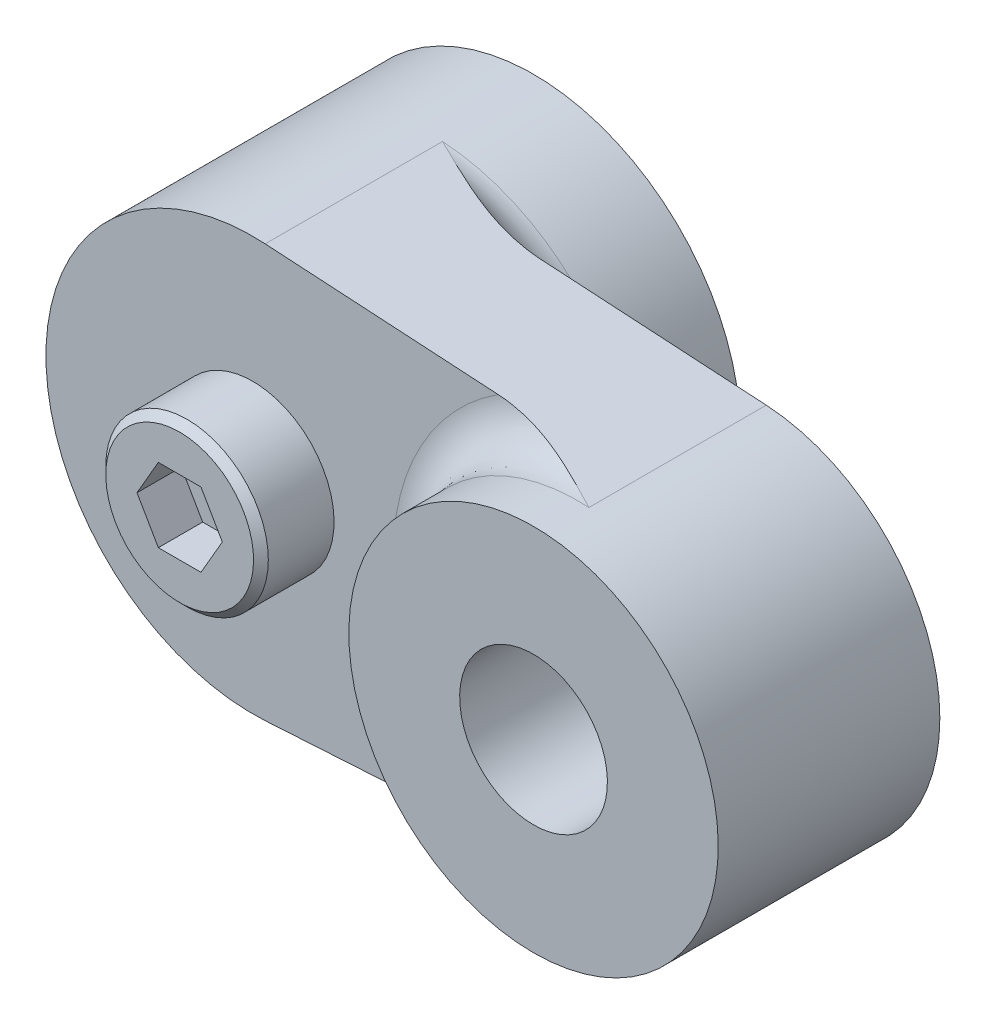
ISO-10303-21;
HEADER;
FILE_DESCRIPTION(('STEP AP214'),'2;1');
FILE_NAME('part.step','',(''),(''),'','','');
FILE_SCHEMA(('AUTOMOTIVE_DESIGN { 1 0 10303 214 1 1 1 1 }'));
ENDSEC;
DATA;
#1=APPLICATION_CONTEXT('core data for automotive mechanical design processes');
#2=APPLICATION_PROTOCOL_DEFINITION('international standard','automotive_design',2000,#1);
#3=PRODUCT_CONTEXT('',#1,'mechanical');
#4=PRODUCT('Part','Part','',(#3));
#5=PRODUCT_RELATED_PRODUCT_CATEGORY('part','',(#4));
#6=PRODUCT_DEFINITION_FORMATION('','',#4);
#7=PRODUCT_DEFINITION_CONTEXT('part definition',#1,'design');
#8=PRODUCT_DEFINITION('design','',#6,#7);
#9=PRODUCT_DEFINITION_SHAPE('','',#8);
#10=(LENGTH_UNIT() NAMED_UNIT(*) SI_UNIT(.MILLI.,.METRE.));
#11=(NAMED_UNIT(*) PLANE_ANGLE_UNIT() SI_UNIT($,.RADIAN.));
#12=(NAMED_UNIT(*) SI_UNIT($,.STERADIAN.) SOLID_ANGLE_UNIT());
#13=UNCERTAINTY_MEASURE_WITH_UNIT(LENGTH_MEASURE(1.E-05),#10,'distance_accuracy_value','');
#14=(GEOMETRIC_REPRESENTATION_CONTEXT(3) GLOBAL_UNCERTAINTY_ASSIGNED_CONTEXT((#13)) GLOBAL_UNIT_ASSIGNED_CONTEXT((#10,
#11,#12)) REPRESENTATION_CONTEXT('',''));
#15=CARTESIAN_POINT('',(0.,0.,0.));
#16=DIRECTION('',(0.,0.,1.));
#17=DIRECTION('',(1.,0.,0.));
#18=AXIS2_PLACEMENT_3D('',#15,#16,#17);
#19=CARTESIAN_POINT('',(25.75,-12.4774797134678,25.));
#20=DIRECTION('',(0.06,-0.998198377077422,0.));
#21=DIRECTION('',(0.998198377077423,0.06,0.));
#22=AXIS2_PLACEMENT_3D('',#19,#20,#21);
#23=PLANE('',#22);
#24=DIRECTION('',(0.,0.,-1.));
#25=VECTOR('',#24,1.);
#26=CARTESIAN_POINT('',(0.84,-13.9747772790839,25.));
#27=LINE('',#26,#25);
#28=CARTESIAN_POINT('',(0.84,-13.9747772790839,19.));
#29=VERTEX_POINT('',#28);
#30=CARTESIAN_POINT('',(0.84,-13.9747772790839,7.));
#31=VERTEX_POINT('',#30);
#32=EDGE_CURVE('E191',#29,#31,#27,.T.);
#33=ORIENTED_EDGE('',*,*,#32,.T.);
#34=CARTESIAN_POINT('',(10.4662765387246,-13.3961582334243,10.));
#35=CARTESIAN_POINT('',(10.2901574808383,-13.4067444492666,9.99997897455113));
#36=CARTESIAN_POINT('',(10.1140935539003,-13.4173273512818,9.99499251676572));
#37=CARTESIAN_POINT('',(9.76254126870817,-13.4384585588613,9.97605534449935));
#38=CARTESIAN_POINT('',(9.58705263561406,-13.4490068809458,9.96210983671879));
#39=CARTESIAN_POINT('',(9.23741470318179,-13.4700230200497,9.92627055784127));
#40=CARTESIAN_POINT('',(9.06326300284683,-13.4804909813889,9.90439977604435));
#41=CARTESIAN_POINT('',(8.71598721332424,-13.5013651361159,9.85351916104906));
#42=CARTESIAN_POINT('',(8.5428632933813,-13.5117713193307,9.82450818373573));
#43=CARTESIAN_POINT('',(8.02934239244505,-13.5426381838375,9.7286557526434));
#44=CARTESIAN_POINT('',(7.69065497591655,-13.5629961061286,9.65253290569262));
#45=CARTESIAN_POINT('',(7.01823457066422,-13.6034141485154,9.48023699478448));
#46=CARTESIAN_POINT('',(6.68450601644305,-13.6234740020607,9.38404702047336));
#47=CARTESIAN_POINT('',(5.8813279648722,-13.671751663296,9.13151508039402));
#48=CARTESIAN_POINT('',(5.4144622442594,-13.6998141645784,8.96698070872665));
#49=CARTESIAN_POINT('',(4.48940947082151,-13.7554175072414,8.61551577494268));
#50=CARTESIAN_POINT('',(4.03122240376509,-13.7829583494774,8.4285852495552));
#51=CARTESIAN_POINT('',(2.66290255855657,-13.8652057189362,7.84532166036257));
#52=CARTESIAN_POINT('',(1.76202665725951,-13.9193558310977,7.42758543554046));
#53=CARTESIAN_POINT('',(0.85429087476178,-13.973918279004,7.00662731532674));
#54=CARTESIAN_POINT('',(0.847145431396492,-13.9743477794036,7.00331364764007));
#55=CARTESIAN_POINT('',(0.84,-13.9747772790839,7.));
#56=B_SPLINE_CURVE_WITH_KNOTS('',3,(#34,#35,#36,#37,#38,#39,#40,#41,#42,#43,#44,#45,#46,#47,#48,
#49,#50,#51,#52,#53,#54,#55),.UNSPECIFIED.,.F.,.F.,(4,2,2,2,2,2,2,2,2,2,4),(0.,
0.529161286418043,1.05801531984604,1.58534739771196,2.1127640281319,3.15510729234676,
4.19833250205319,5.68482585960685,7.17131677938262,10.1538893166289,10.1775536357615),.UNSPECIFIED.);
#57=CARTESIAN_POINT('',(10.4662765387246,-13.3961582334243,10.));
#58=VERTEX_POINT('',#57);
#59=EDGE_CURVE('E37',#31,#58,#56,.F.);
#60=ORIENTED_EDGE('',*,*,#59,.T.);
#61=DIRECTION('',(-0.998198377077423,-0.06,0.));
#62=VECTOR('',#61,1.);
#63=CARTESIAN_POINT('',(25.75,-12.4774797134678,10.));
#64=LINE('',#63,#62);
#65=CARTESIAN_POINT('',(25.75,-12.4774797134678,10.));
#66=VERTEX_POINT('',#65);
#67=EDGE_CURVE('E163',#66,#58,#64,.T.);
#68=ORIENTED_EDGE('',*,*,#67,.F.);
#69=DIRECTION('',(0.,0.,-1.));
#70=VECTOR('',#69,1.);
#71=CARTESIAN_POINT('',(25.75,-12.4774797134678,25.));
#72=LINE('',#71,#70);
#73=CARTESIAN_POINT('',(25.75,-12.4774797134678,22.));
#74=VERTEX_POINT('',#73);
#75=EDGE_CURVE('E188',#74,#66,#72,.T.);
#76=ORIENTED_EDGE('',*,*,#75,.F.);
#77=CARTESIAN_POINT('',(16.6013607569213,-13.0273887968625,19.));
#78=CARTESIAN_POINT('',(16.7645065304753,-13.0175823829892,19.0000163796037));
#79=CARTESIAN_POINT('',(16.9276028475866,-13.0077789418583,19.0046687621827));
#80=CARTESIAN_POINT('',(17.2532529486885,-12.9882046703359,19.0223867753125));
#81=CARTESIAN_POINT('',(17.4158069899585,-12.9784338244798,19.0354475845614));
#82=CARTESIAN_POINT('',(17.739642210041,-12.9589686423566,19.0690764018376));
#83=CARTESIAN_POINT('',(17.900925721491,-12.9492741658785,19.0896223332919));
#84=CARTESIAN_POINT('',(18.2225001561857,-12.9299448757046,19.1374908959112));
#85=CARTESIAN_POINT('',(18.3827909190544,-12.9203100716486,19.164814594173));
#86=CARTESIAN_POINT('',(18.8578431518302,-12.8917554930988,19.2551475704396));
#87=CARTESIAN_POINT('',(19.1709492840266,-12.8729352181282,19.326988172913));
#88=CARTESIAN_POINT('',(19.7922779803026,-12.8355882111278,19.4899355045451));
#89=CARTESIAN_POINT('',(20.1004961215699,-12.8170617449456,19.5810587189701));
#90=CARTESIAN_POINT('',(20.8658664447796,-12.7710566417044,19.8284891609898));
#91=CARTESIAN_POINT('',(21.3198697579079,-12.7437672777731,19.9945156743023));
#92=CARTESIAN_POINT('',(22.2181612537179,-12.6897725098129,20.3506648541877));
#93=CARTESIAN_POINT('',(22.6624485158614,-12.6630671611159,20.5407897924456));
#94=CARTESIAN_POINT('',(23.9882324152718,-12.5833765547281,21.1353894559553));
#95=CARTESIAN_POINT('',(24.8592612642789,-12.5310204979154,21.5628415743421));
#96=CARTESIAN_POINT('',(25.7366371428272,-12.4782829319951,21.9934417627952));
#97=CARTESIAN_POINT('',(25.74331857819,-12.4778813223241,21.996720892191));
#98=CARTESIAN_POINT('',(25.75,-12.4774797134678,22.));
#99=B_SPLINE_CURVE_WITH_KNOTS('',3,(#77,#78,#79,#80,#81,#82,#83,#84,#85,#86,#87,#88,#89,#90,#91,
#92,#93,#94,#95,#96,#97,#98),.UNSPECIFIED.,.F.,.F.,(4,2,2,2,2,2,2,2,2,2,4),(0.,
0.490183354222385,0.980085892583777,1.46855506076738,1.95710118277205,2.92163302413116,
3.88699282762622,5.33841179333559,6.78996768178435,9.70390170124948,9.72626238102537),.UNSPECIFIED.);
#100=CARTESIAN_POINT('',(16.6013607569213,-13.0273887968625,19.));
#101=VERTEX_POINT('',#100);
#102=EDGE_CURVE('E203',#74,#101,#99,.F.);
#103=ORIENTED_EDGE('',*,*,#102,.T.);
#104=DIRECTION('',(0.998198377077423,0.06,0.));
#105=VECTOR('',#104,1.);
#106=CARTESIAN_POINT('',(0.84,-13.9747772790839,19.));
#107=LINE('',#106,#105);
#108=EDGE_CURVE('E171',#29,#101,#107,.T.);
#109=ORIENTED_EDGE('',*,*,#108,.F.);
#110=EDGE_LOOP('',(#33,#60,#68,#76,#103,#109));
#111=FACE_BOUND('',#110,.T.);
#112=ADVANCED_FACE('F14',(#111),#23,.T.);
#113=CARTESIAN_POINT('',(25.75,12.4774797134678,25.));
#114=DIRECTION('',(-0.06,-0.998198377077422,0.));
#115=DIRECTION('',(0.998198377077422,-0.06,0.));
#116=AXIS2_PLACEMENT_3D('',#113,#114,#115);
#117=PLANE('',#116);
#118=DIRECTION('',(0.998198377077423,-0.06,0.));
#119=VECTOR('',#118,1.);
#120=CARTESIAN_POINT('',(0.84,13.9747772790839,10.));
#121=LINE('',#120,#119);
#122=CARTESIAN_POINT('',(10.4662765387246,13.3961582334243,10.));
#123=VERTEX_POINT('',#122);
#124=CARTESIAN_POINT('',(25.75,12.4774797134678,10.));
#125=VERTEX_POINT('',#124);
#126=EDGE_CURVE('E167',#123,#125,#121,.T.);
#127=ORIENTED_EDGE('',*,*,#126,.F.);
#128=CARTESIAN_POINT('',(10.4662765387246,13.3961582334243,10.));
#129=CARTESIAN_POINT('',(10.2901574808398,13.4067444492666,9.99997897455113));
#130=CARTESIAN_POINT('',(10.1140935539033,13.4173273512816,9.99499251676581));
#131=CARTESIAN_POINT('',(9.76254126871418,13.4384585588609,9.97605534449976));
#132=CARTESIAN_POINT('',(9.58705263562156,13.4490068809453,9.96210983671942));
#133=CARTESIAN_POINT('',(9.23741470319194,13.4700230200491,9.92627055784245));
#134=CARTESIAN_POINT('',(9.06326300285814,13.4804909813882,9.90439977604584));
#135=CARTESIAN_POINT('',(8.71598721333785,13.5013651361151,9.85351916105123));
#136=CARTESIAN_POINT('',(8.54286329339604,13.5117713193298,9.82450818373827));
#137=CARTESIAN_POINT('',(8.02934239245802,13.5426381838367,9.72865575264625));
#138=CARTESIAN_POINT('',(7.69065497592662,13.5629961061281,9.65253290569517));
#139=CARTESIAN_POINT('',(7.01823457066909,13.6034141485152,9.48023699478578));
#140=CARTESIAN_POINT('',(6.68450601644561,13.6234740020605,9.38404702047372));
#141=CARTESIAN_POINT('',(5.88132796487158,13.6717516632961,9.13151508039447));
#142=CARTESIAN_POINT('',(5.41446224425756,13.6998141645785,8.96698070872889));
#143=CARTESIAN_POINT('',(4.48940947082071,13.7554175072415,8.61551577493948));
#144=CARTESIAN_POINT('',(4.03122240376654,13.7829583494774,8.42858524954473));
#145=CARTESIAN_POINT('',(2.66290255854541,13.8652057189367,7.84532166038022));
#146=CARTESIAN_POINT('',(1.76202665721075,13.9193558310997,7.42758543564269));
#147=CARTESIAN_POINT('',(0.85429087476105,13.973918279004,7.00662731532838));
#148=CARTESIAN_POINT('',(0.847145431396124,13.9743477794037,7.0033136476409));
#149=CARTESIAN_POINT('',(0.84,13.9747772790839,7.));
#150=B_SPLINE_CURVE_WITH_KNOTS('',3,(#128,#129,#130,#131,#132,#133,#134,#135,#136,#137,#138,
#139,#140,#141,#142,#143,#144,#145,#146,#147,#148,#149),.UNSPECIFIED.,.F.,.F.,(4,2,2,2,2,2,2,2,
2,2,4),(0.,0.529161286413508,1.05801531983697,1.58534739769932,2.11276402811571,
3.15510729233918,4.1983325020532,5.68482585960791,7.17131677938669,10.1538893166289,
10.1775536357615),.UNSPECIFIED.);
#151=CARTESIAN_POINT('',(0.84,13.9747772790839,7.));
#152=VERTEX_POINT('',#151);
#153=EDGE_CURVE('E255',#123,#152,#150,.T.);
#154=ORIENTED_EDGE('',*,*,#153,.T.);
#155=DIRECTION('',(0.,0.,-1.));
#156=VECTOR('',#155,1.);
#157=CARTESIAN_POINT('',(0.84,13.9747772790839,25.));
#158=LINE('',#157,#156);
#159=CARTESIAN_POINT('',(0.84,13.9747772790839,19.));
#160=VERTEX_POINT('',#159);
#161=EDGE_CURVE('E182',#160,#152,#158,.T.);
#162=ORIENTED_EDGE('',*,*,#161,.F.);
#163=DIRECTION('',(-0.998198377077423,0.06,0.));
#164=VECTOR('',#163,1.);
#165=CARTESIAN_POINT('',(25.75,12.4774797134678,19.));
#166=LINE('',#165,#164);
#167=CARTESIAN_POINT('',(16.6013607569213,13.0273887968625,19.));
#168=VERTEX_POINT('',#167);
#169=EDGE_CURVE('E174',#168,#160,#166,.T.);
#170=ORIENTED_EDGE('',*,*,#169,.F.);
#171=CARTESIAN_POINT('',(16.6013607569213,13.0273887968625,19.));
#172=CARTESIAN_POINT('',(16.7645065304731,13.0175823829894,19.0000163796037));
#173=CARTESIAN_POINT('',(16.9276028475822,13.0077789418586,19.0046687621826));
#174=CARTESIAN_POINT('',(17.2532529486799,12.9882046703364,19.0223867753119));
#175=CARTESIAN_POINT('',(17.4158069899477,12.9784338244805,19.0354475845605));
#176=CARTESIAN_POINT('',(17.7396422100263,12.9589686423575,19.0690764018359));
#177=CARTESIAN_POINT('',(17.9009257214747,12.9492741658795,19.0896223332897));
#178=CARTESIAN_POINT('',(18.2225001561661,12.9299448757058,19.137490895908));
#179=CARTESIAN_POINT('',(18.3827909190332,12.9203100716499,19.1648145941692));
#180=CARTESIAN_POINT('',(18.8578431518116,12.8917554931,19.2551475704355));
#181=CARTESIAN_POINT('',(19.1709492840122,12.8729352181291,19.3269881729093));
#182=CARTESIAN_POINT('',(19.7922779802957,12.8355882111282,19.4899355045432));
#183=CARTESIAN_POINT('',(20.1004961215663,12.8170617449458,19.5810587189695));
#184=CARTESIAN_POINT('',(20.8658664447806,12.7710566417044,19.8284891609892));
#185=CARTESIAN_POINT('',(21.3198697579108,12.743767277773,19.9945156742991));
#186=CARTESIAN_POINT('',(22.2181612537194,12.6897725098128,20.3506648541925));
#187=CARTESIAN_POINT('',(22.6624485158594,12.6630671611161,20.5407897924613));
#188=CARTESIAN_POINT('',(23.9882324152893,12.583376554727,21.1353894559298));
#189=CARTESIAN_POINT('',(24.8592612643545,12.5310204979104,21.5628415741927));
#190=CARTESIAN_POINT('',(25.7366371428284,12.478282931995,21.9934417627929));
#191=CARTESIAN_POINT('',(25.7433185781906,12.4778813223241,21.9967208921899));
#192=CARTESIAN_POINT('',(25.75,12.4774797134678,22.));
#193=B_SPLINE_CURVE_WITH_KNOTS('',3,(#171,#172,#173,#174,#175,#176,#177,#178,#179,#180,#181,
#182,#183,#184,#185,#186,#187,#188,#189,#190,#191,#192),.UNSPECIFIED.,.F.,.F.,(4,2,2,2,2,2,2,2,
2,2,4),(0.,0.490183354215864,0.98008589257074,1.46855506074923,1.9571011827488,2.92163302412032,
3.88699282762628,5.33841179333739,6.78996768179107,9.70390170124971,9.72626238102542),.UNSPECIFIED.);
#194=CARTESIAN_POINT('',(25.75,12.4774797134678,22.));
#195=VERTEX_POINT('',#194);
#196=EDGE_CURVE('E210',#168,#195,#193,.T.);
#197=ORIENTED_EDGE('',*,*,#196,.T.);
#198=DIRECTION('',(0.,0.,-1.));
#199=VECTOR('',#198,1.);
#200=CARTESIAN_POINT('',(25.75,12.4774797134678,25.));
#201=LINE('',#200,#199);
#202=EDGE_CURVE('E185',#195,#125,#201,.T.);
#203=ORIENTED_EDGE('',*,*,#202,.T.);
#204=EDGE_LOOP('',(#127,#154,#162,#170,#197,#203));
#205=FACE_BOUND('',#204,.T.);
#206=ADVANCED_FACE('F249',(#205),#117,.F.);
#207=CARTESIAN_POINT('',(25.,0.,25.));
#208=DIRECTION('',(0.,0.,-1.));
#209=DIRECTION('',(0.,1.,0.));
#210=AXIS2_PLACEMENT_3D('',#207,#208,#209);
#211=CYLINDRICAL_SURFACE('',#210,12.5);
#212=CARTESIAN_POINT('',(25.,0.,25.));
#213=DIRECTION('',(0.,0.,1.));
#214=DIRECTION('',(0.,-1.,0.));
#215=AXIS2_PLACEMENT_3D('',#212,#213,#214);
#216=CIRCLE('',#215,12.5);
#217=CARTESIAN_POINT('',(25.,-12.5,25.));
#218=VERTEX_POINT('',#217);
#219=EDGE_CURVE('E179',#218,#218,#216,.T.);
#220=ORIENTED_EDGE('',*,*,#219,.F.);
#221=EDGE_LOOP('',(#220));
#222=FACE_BOUND('',#221,.T.);
#223=CARTESIAN_POINT('',(25.,0.,22.));
#224=DIRECTION('',(0.,0.,1.));
#225=DIRECTION('',(0.,-1.,0.));
#226=AXIS2_PLACEMENT_3D('',#223,#224,#225);
#227=CIRCLE('',#226,12.5);
#228=EDGE_CURVE('E193',#195,#74,#227,.T.);
#229=ORIENTED_EDGE('',*,*,#228,.T.);
#230=ORIENTED_EDGE('',*,*,#75,.T.);
#231=CARTESIAN_POINT('',(25.,0.,10.));
#232=DIRECTION('',(0.,0.,-1.));
#233=DIRECTION('',(0.,1.,0.));
#234=AXIS2_PLACEMENT_3D('',#231,#232,#233);
#235=CIRCLE('',#234,12.5);
#236=EDGE_CURVE('E165',#125,#66,#235,.T.);
#237=ORIENTED_EDGE('',*,*,#236,.F.);
#238=ORIENTED_EDGE('',*,*,#202,.F.);
#239=EDGE_LOOP('',(#229,#230,#237,#238));
#240=FACE_BOUND('',#239,.T.);
#241=ADVANCED_FACE('F242',(#222,#240),#211,.T.);
#242=CARTESIAN_POINT('',(0.,0.,0.));
#243=DIRECTION('',(0.,0.,1.));
#244=DIRECTION('',(0.,-1.,0.));
#245=AXIS2_PLACEMENT_3D('',#242,#243,#244);
#246=PLANE('',#245);
#247=CARTESIAN_POINT('',(0.,0.,0.));
#248=DIRECTION('',(0.,0.,1.));
#249=DIRECTION('',(0.,-1.,0.));
#250=AXIS2_PLACEMENT_3D('',#247,#248,#249);
#251=CIRCLE('',#250,14.);
#252=CARTESIAN_POINT('',(0.,-14.,0.));
#253=VERTEX_POINT('',#252);
#254=EDGE_CURVE('E176',#253,#253,#251,.T.);
#255=ORIENTED_EDGE('',*,*,#254,.F.);
#256=EDGE_LOOP('',(#255));
#257=FACE_BOUND('',#256,.T.);
#258=ADVANCED_FACE('F238',(#257),#246,.F.);
#259=CARTESIAN_POINT('',(0.,0.,25.));
#260=DIRECTION('',(0.,0.,-1.));
#261=DIRECTION('',(0.,1.,0.));
#262=AXIS2_PLACEMENT_3D('',#259,#260,#261);
#263=CYLINDRICAL_SURFACE('',#262,14.);
#264=ORIENTED_EDGE('',*,*,#254,.T.);
#265=EDGE_LOOP('',(#264));
#266=FACE_BOUND('',#265,.T.);
#267=CARTESIAN_POINT('',(0.,0.,7.));
#268=DIRECTION('',(0.,0.,-1.));
#269=DIRECTION('',(0.,1.,0.));
#270=AXIS2_PLACEMENT_3D('',#267,#268,#269);
#271=CIRCLE('',#270,14.);
#272=EDGE_CURVE('E198',#152,#31,#271,.T.);
#273=ORIENTED_EDGE('',*,*,#272,.T.);
#274=ORIENTED_EDGE('',*,*,#32,.F.);
#275=CARTESIAN_POINT('',(0.,0.,19.));
#276=DIRECTION('',(0.,0.,1.));
#277=DIRECTION('',(0.,-1.,0.));
#278=AXIS2_PLACEMENT_3D('',#275,#276,#277);
#279=CIRCLE('',#278,14.);
#280=EDGE_CURVE('E169',#160,#29,#279,.T.);
#281=ORIENTED_EDGE('',*,*,#280,.F.);
#282=ORIENTED_EDGE('',*,*,#161,.T.);
#283=EDGE_LOOP('',(#273,#274,#281,#282));
#284=FACE_BOUND('',#283,.T.);
#285=ADVANCED_FACE('F241',(#266,#284),#263,.T.);
#286=CARTESIAN_POINT('',(0.,0.,25.));
#287=DIRECTION('',(0.,0.,1.));
#288=DIRECTION('',(0.,-1.,0.));
#289=AXIS2_PLACEMENT_3D('',#286,#287,#288);
#290=PLANE('',#289);
#291=CARTESIAN_POINT('',(25.,0.,25.));
#292=DIRECTION('',(0.,0.,1.));
#293=DIRECTION('',(0.,-1.,0.));
#294=AXIS2_PLACEMENT_3D('',#291,#292,#293);
#295=CIRCLE('',#294,5.);
#296=CARTESIAN_POINT('',(25.,-5.,25.));
#297=VERTEX_POINT('',#296);
#298=EDGE_CURVE('E159',#297,#297,#295,.T.);
#299=ORIENTED_EDGE('',*,*,#298,.F.);
#300=EDGE_LOOP('',(#299));
#301=FACE_BOUND('',#300,.T.);
#302=ORIENTED_EDGE('',*,*,#219,.T.);
#303=EDGE_LOOP('',(#302));
#304=FACE_BOUND('',#303,.T.);
#305=ADVANCED_FACE('F236',(#301,#304),#290,.T.);
#306=CARTESIAN_POINT('',(0.,0.,19.));
#307=DIRECTION('',(0.,0.,1.));
#308=DIRECTION('',(0.,-1.,0.));
#309=AXIS2_PLACEMENT_3D('',#306,#307,#308);
#310=PLANE('',#309);
#311=ORIENTED_EDGE('',*,*,#108,.T.);
#312=CARTESIAN_POINT('',(25.,0.,19.));
#313=DIRECTION('',(0.,0.,1.));
#314=DIRECTION('',(0.,-1.,0.));
#315=AXIS2_PLACEMENT_3D('',#312,#313,#314);
#316=CIRCLE('',#315,15.5);
#317=EDGE_CURVE('E196',#101,#168,#316,.F.);
#318=ORIENTED_EDGE('',*,*,#317,.T.);
#319=ORIENTED_EDGE('',*,*,#169,.T.);
#320=ORIENTED_EDGE('',*,*,#280,.T.);
#321=EDGE_LOOP('',(#311,#318,#319,#320));
#322=FACE_BOUND('',#321,.T.);
#323=CARTESIAN_POINT('',(0.,0.,19.));
#324=DIRECTION('',(0.,0.,1.));
#325=DIRECTION('',(0.,-1.,0.));
#326=AXIS2_PLACEMENT_3D('',#323,#324,#325);
#327=CIRCLE('',#326,5.5);
#328=CARTESIAN_POINT('',(0.,-5.5,19.));
#329=VERTEX_POINT('',#328);
#330=EDGE_CURVE('E305',#329,#329,#327,.F.);
#331=ORIENTED_EDGE('',*,*,#330,.T.);
#332=EDGE_LOOP('',(#331));
#333=FACE_BOUND('',#332,.T.);
#334=ADVANCED_FACE('F232',(#322,#333),#310,.T.);
#335=CARTESIAN_POINT('',(0.,0.,10.));
#336=DIRECTION('',(0.,0.,-1.));
#337=DIRECTION('',(0.,1.,0.));
#338=AXIS2_PLACEMENT_3D('',#335,#336,#337);
#339=PLANE('',#338);
#340=CARTESIAN_POINT('',(25.,0.,10.));
#341=DIRECTION('',(0.,0.,-1.));
#342=DIRECTION('',(0.,1.,0.));
#343=AXIS2_PLACEMENT_3D('',#340,#341,#342);
#344=CIRCLE('',#343,5.);
#345=CARTESIAN_POINT('',(25.,5.,10.));
#346=VERTEX_POINT('',#345);
#347=EDGE_CURVE('E162',#346,#346,#344,.T.);
#348=ORIENTED_EDGE('',*,*,#347,.F.);
#349=EDGE_LOOP('',(#348));
#350=FACE_BOUND('',#349,.T.);
#351=ORIENTED_EDGE('',*,*,#67,.T.);
#352=CARTESIAN_POINT('',(0.,0.,10.));
#353=DIRECTION('',(0.,0.,-1.));
#354=DIRECTION('',(0.,1.,0.));
#355=AXIS2_PLACEMENT_3D('',#352,#353,#354);
#356=CIRCLE('',#355,17.);
#357=EDGE_CURVE('E201',#58,#123,#356,.F.);
#358=ORIENTED_EDGE('',*,*,#357,.T.);
#359=ORIENTED_EDGE('',*,*,#126,.T.);
#360=ORIENTED_EDGE('',*,*,#236,.T.);
#361=EDGE_LOOP('',(#351,#358,#359,#360));
#362=FACE_BOUND('',#361,.T.);
#363=ADVANCED_FACE('F225',(#350,#362),#339,.T.);
#364=CARTESIAN_POINT('',(25.,0.,22.));
#365=DIRECTION('',(0.,0.,1.));
#366=DIRECTION('',(0.,-1.,0.));
#367=AXIS2_PLACEMENT_3D('',#364,#365,#366);
#368=TOROIDAL_SURFACE('',#367,15.5,3.);
#369=ORIENTED_EDGE('',*,*,#196,.F.);
#370=ORIENTED_EDGE('',*,*,#317,.F.);
#371=ORIENTED_EDGE('',*,*,#102,.F.);
#372=ORIENTED_EDGE('',*,*,#228,.F.);
#373=EDGE_LOOP('',(#369,#370,#371,#372));
#374=FACE_BOUND('',#373,.T.);
#375=ADVANCED_FACE('F219',(#374),#368,.F.);
#376=CARTESIAN_POINT('',(0.,0.,7.));
#377=DIRECTION('',(0.,0.,-1.));
#378=DIRECTION('',(0.,1.,0.));
#379=AXIS2_PLACEMENT_3D('',#376,#377,#378);
#380=TOROIDAL_SURFACE('',#379,17.,3.);
#381=ORIENTED_EDGE('',*,*,#153,.F.);
#382=ORIENTED_EDGE('',*,*,#357,.F.);
#383=ORIENTED_EDGE('',*,*,#59,.F.);
#384=ORIENTED_EDGE('',*,*,#272,.F.);
#385=EDGE_LOOP('',(#381,#382,#383,#384));
#386=FACE_BOUND('',#385,.T.);
#387=ADVANCED_FACE('F224',(#386),#380,.F.);
#388=CARTESIAN_POINT('',(25.,0.,0.));
#389=DIRECTION('',(0.,0.,1.));
#390=DIRECTION('',(0.,-1.,0.));
#391=AXIS2_PLACEMENT_3D('',#388,#389,#390);
#392=CYLINDRICAL_SURFACE('',#391,5.);
#393=ORIENTED_EDGE('',*,*,#347,.T.);
#394=EDGE_LOOP('',(#393));
#395=FACE_BOUND('',#394,.T.);
#396=ORIENTED_EDGE('',*,*,#298,.T.);
#397=EDGE_LOOP('',(#396));
#398=FACE_BOUND('',#397,.T.);
#399=ADVANCED_FACE('F311',(#395,#398),#392,.F.);
#400=CARTESIAN_POINT('',(0.,0.,-1.07325568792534));
#401=DIRECTION('',(0.,0.,1.));
#402=DIRECTION('',(0.,-1.,0.));
#403=AXIS2_PLACEMENT_3D('',#400,#401,#402);
#404=CYLINDRICAL_SURFACE('',#403,5.5);
#405=CARTESIAN_POINT('',(0.,0.,23.45));
#406=DIRECTION('',(0.,0.,-1.));
#407=DIRECTION('',(0.,1.,0.));
#408=AXIS2_PLACEMENT_3D('',#405,#406,#407);
#409=CIRCLE('',#408,5.5);
#410=CARTESIAN_POINT('',(0.,5.5,23.45));
#411=VERTEX_POINT('',#410);
#412=EDGE_CURVE('E9',#411,#411,#409,.T.);
#413=ORIENTED_EDGE('',*,*,#412,.T.);
#414=EDGE_LOOP('',(#413));
#415=FACE_BOUND('',#414,.T.);
#416=ORIENTED_EDGE('',*,*,#330,.F.);
#417=EDGE_LOOP('',(#416));
#418=FACE_BOUND('',#417,.T.);
#419=ADVANCED_FACE('F308',(#415,#418),#404,.T.);
#420=CARTESIAN_POINT('',(0.,5.,20.95));
#421=DIRECTION('',(0.,0.,1.));
#422=DIRECTION('',(0.,-1.,0.));
#423=AXIS2_PLACEMENT_3D('',#420,#421,#422);
#424=PLANE('',#423);
#425=DIRECTION('',(-0.500000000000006,-0.866025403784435,0.));
#426=VECTOR('',#425,1.);
#427=CARTESIAN_POINT('',(-1.44337567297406,2.5,20.95));
#428=LINE('',#427,#426);
#429=CARTESIAN_POINT('',(-1.44337567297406,2.5,20.95));
#430=VERTEX_POINT('',#429);
#431=CARTESIAN_POINT('',(-2.88675134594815,0.,20.95));
#432=VERTEX_POINT('',#431);
#433=EDGE_CURVE('E136',#430,#432,#428,.T.);
#434=ORIENTED_EDGE('',*,*,#433,.T.);
#435=DIRECTION('',(-0.5,0.866025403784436,0.));
#436=VECTOR('',#435,1.);
#437=CARTESIAN_POINT('',(-1.44337567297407,-2.5,20.95));
#438=LINE('',#437,#436);
#439=CARTESIAN_POINT('',(-1.44337567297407,-2.5,20.95));
#440=VERTEX_POINT('',#439);
#441=EDGE_CURVE('E139',#440,#432,#438,.T.);
#442=ORIENTED_EDGE('',*,*,#441,.F.);
#443=DIRECTION('',(-1.,0.,0.));
#444=VECTOR('',#443,1.);
#445=CARTESIAN_POINT('',(1.44337567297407,-2.5,20.95));
#446=LINE('',#445,#444);
#447=CARTESIAN_POINT('',(1.44337567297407,-2.5,20.95));
#448=VERTEX_POINT('',#447);
#449=EDGE_CURVE('E111',#448,#440,#446,.T.);
#450=ORIENTED_EDGE('',*,*,#449,.F.);
#451=DIRECTION('',(0.5,0.866025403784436,0.));
#452=VECTOR('',#451,1.);
#453=CARTESIAN_POINT('',(1.44337567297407,-2.5,20.95));
#454=LINE('',#453,#452);
#455=CARTESIAN_POINT('',(2.88675134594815,0.,20.95));
#456=VERTEX_POINT('',#455);
#457=EDGE_CURVE('E142',#448,#456,#454,.T.);
#458=ORIENTED_EDGE('',*,*,#457,.T.);
#459=DIRECTION('',(0.5,-0.866025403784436,0.));
#460=VECTOR('',#459,1.);
#461=CARTESIAN_POINT('',(1.44337567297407,2.5,20.95));
#462=LINE('',#461,#460);
#463=CARTESIAN_POINT('',(1.44337567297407,2.5,20.95));
#464=VERTEX_POINT('',#463);
#465=EDGE_CURVE('E145',#464,#456,#462,.T.);
#466=ORIENTED_EDGE('',*,*,#465,.F.);
#467=DIRECTION('',(-1.,0.,0.));
#468=VECTOR('',#467,1.);
#469=CARTESIAN_POINT('',(1.44337567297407,2.5,20.95));
#470=LINE('',#469,#468);
#471=EDGE_CURVE('E148',#464,#430,#470,.T.);
#472=ORIENTED_EDGE('',*,*,#471,.T.);
#473=EDGE_LOOP('',(#434,#442,#450,#458,#466,#472));
#474=FACE_BOUND('',#473,.T.);
#475=ADVANCED_FACE('F310',(#474),#424,.T.);
#476=CARTESIAN_POINT('',(1.44337567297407,-2.5,20.95));
#477=DIRECTION('',(0.,1.,0.));
#478=DIRECTION('',(0.,0.,1.));
#479=AXIS2_PLACEMENT_3D('',#476,#477,#478);
#480=PLANE('',#479);
#481=DIRECTION('',(0.,0.,1.));
#482=VECTOR('',#481,1.);
#483=CARTESIAN_POINT('',(-1.44337567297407,-2.5,20.95));
#484=LINE('',#483,#482);
#485=CARTESIAN_POINT('',(-1.44337567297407,-2.5,23.95));
#486=VERTEX_POINT('',#485);
#487=EDGE_CURVE('E104',#440,#486,#484,.T.);
#488=ORIENTED_EDGE('',*,*,#487,.T.);
#489=DIRECTION('',(-1.,0.,0.));
#490=VECTOR('',#489,1.);
#491=CARTESIAN_POINT('',(1.44337567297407,-2.5,23.95));
#492=LINE('',#491,#490);
#493=CARTESIAN_POINT('',(1.44337567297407,-2.5,23.95));
#494=VERTEX_POINT('',#493);
#495=EDGE_CURVE('E108',#494,#486,#492,.T.);
#496=ORIENTED_EDGE('',*,*,#495,.F.);
#497=DIRECTION('',(0.,0.,1.));
#498=VECTOR('',#497,1.);
#499=CARTESIAN_POINT('',(1.44337567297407,-2.5,20.95));
#500=LINE('',#499,#498);
#501=EDGE_CURVE('E115',#448,#494,#500,.T.);
#502=ORIENTED_EDGE('',*,*,#501,.F.);
#503=ORIENTED_EDGE('',*,*,#449,.T.);
#504=EDGE_LOOP('',(#488,#496,#502,#503));
#505=FACE_BOUND('',#504,.T.);
#506=ADVANCED_FACE('F106',(#505),#480,.T.);
#507=CARTESIAN_POINT('',(1.44337567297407,-2.5,20.95));
#508=DIRECTION('',(0.866025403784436,-0.5,0.));
#509=DIRECTION('',(0.5,0.866025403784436,0.));
#510=AXIS2_PLACEMENT_3D('',#507,#508,#509);
#511=PLANE('',#510);
#512=ORIENTED_EDGE('',*,*,#501,.T.);
#513=DIRECTION('',(0.5,0.866025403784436,0.));
#514=VECTOR('',#513,1.);
#515=CARTESIAN_POINT('',(1.44337567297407,-2.5,23.95));
#516=LINE('',#515,#514);
#517=CARTESIAN_POINT('',(2.88675134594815,0.,23.95));
#518=VERTEX_POINT('',#517);
#519=EDGE_CURVE('E126',#494,#518,#516,.T.);
#520=ORIENTED_EDGE('',*,*,#519,.T.);
#521=DIRECTION('',(0.,0.,1.));
#522=VECTOR('',#521,1.);
#523=CARTESIAN_POINT('',(2.88675134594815,0.,20.95));
#524=LINE('',#523,#522);
#525=EDGE_CURVE('E153',#456,#518,#524,.T.);
#526=ORIENTED_EDGE('',*,*,#525,.F.);
#527=ORIENTED_EDGE('',*,*,#457,.F.);
#528=EDGE_LOOP('',(#512,#520,#526,#527));
#529=FACE_BOUND('',#528,.T.);
#530=ADVANCED_FACE('F331',(#529),#511,.F.);
#531=CARTESIAN_POINT('',(1.44337567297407,2.5,20.95));
#532=DIRECTION('',(-0.866025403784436,-0.5,0.));
#533=DIRECTION('',(0.5,-0.866025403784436,0.));
#534=AXIS2_PLACEMENT_3D('',#531,#532,#533);
#535=PLANE('',#534);
#536=ORIENTED_EDGE('',*,*,#525,.T.);
#537=DIRECTION('',(0.5,-0.866025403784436,0.));
#538=VECTOR('',#537,1.);
#539=CARTESIAN_POINT('',(1.44337567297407,2.5,23.95));
#540=LINE('',#539,#538);
#541=CARTESIAN_POINT('',(1.44337567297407,2.5,23.95));
#542=VERTEX_POINT('',#541);
#543=EDGE_CURVE('E128',#542,#518,#540,.T.);
#544=ORIENTED_EDGE('',*,*,#543,.F.);
#545=DIRECTION('',(0.,0.,1.));
#546=VECTOR('',#545,1.);
#547=CARTESIAN_POINT('',(1.44337567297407,2.5,20.95));
#548=LINE('',#547,#546);
#549=EDGE_CURVE('E155',#464,#542,#548,.T.);
#550=ORIENTED_EDGE('',*,*,#549,.F.);
#551=ORIENTED_EDGE('',*,*,#465,.T.);
#552=EDGE_LOOP('',(#536,#544,#550,#551));
#553=FACE_BOUND('',#552,.T.);
#554=ADVANCED_FACE('F334',(#553),#535,.T.);
#555=CARTESIAN_POINT('',(1.44337567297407,2.5,20.95));
#556=DIRECTION('',(0.,1.,0.));
#557=DIRECTION('',(-1.,0.,0.));
#558=AXIS2_PLACEMENT_3D('',#555,#556,#557);
#559=PLANE('',#558);
#560=ORIENTED_EDGE('',*,*,#549,.T.);
#561=DIRECTION('',(-1.,0.,0.));
#562=VECTOR('',#561,1.);
#563=CARTESIAN_POINT('',(1.44337567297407,2.5,23.95));
#564=LINE('',#563,#562);
#565=CARTESIAN_POINT('',(-1.44337567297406,2.5,23.95));
#566=VERTEX_POINT('',#565);
#567=EDGE_CURVE('E133',#542,#566,#564,.T.);
#568=ORIENTED_EDGE('',*,*,#567,.T.);
#569=DIRECTION('',(0.,0.,1.));
#570=VECTOR('',#569,1.);
#571=CARTESIAN_POINT('',(-1.44337567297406,2.5,20.95));
#572=LINE('',#571,#570);
#573=EDGE_CURVE('E157',#430,#566,#572,.T.);
#574=ORIENTED_EDGE('',*,*,#573,.F.);
#575=ORIENTED_EDGE('',*,*,#471,.F.);
#576=EDGE_LOOP('',(#560,#568,#574,#575));
#577=FACE_BOUND('',#576,.T.);
#578=ADVANCED_FACE('F326',(#577),#559,.F.);
#579=CARTESIAN_POINT('',(-1.44337567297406,2.5,20.95));
#580=DIRECTION('',(-0.866025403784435,0.500000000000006,0.));
#581=DIRECTION('',(-0.500000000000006,-0.866025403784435,0.));
#582=AXIS2_PLACEMENT_3D('',#579,#580,#581);
#583=PLANE('',#582);
#584=ORIENTED_EDGE('',*,*,#573,.T.);
#585=DIRECTION('',(-0.500000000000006,-0.866025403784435,0.));
#586=VECTOR('',#585,1.);
#587=CARTESIAN_POINT('',(-1.44337567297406,2.5,23.95));
#588=LINE('',#587,#586);
#589=CARTESIAN_POINT('',(-2.88675134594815,0.,23.95));
#590=VERTEX_POINT('',#589);
#591=EDGE_CURVE('E29',#566,#590,#588,.T.);
#592=ORIENTED_EDGE('',*,*,#591,.T.);
#593=DIRECTION('',(0.,0.,1.));
#594=VECTOR('',#593,1.);
#595=CARTESIAN_POINT('',(-2.88675134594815,0.,20.95));
#596=LINE('',#595,#594);
#597=EDGE_CURVE('E116',#432,#590,#596,.T.);
#598=ORIENTED_EDGE('',*,*,#597,.F.);
#599=ORIENTED_EDGE('',*,*,#433,.F.);
#600=EDGE_LOOP('',(#584,#592,#598,#599));
#601=FACE_BOUND('',#600,.T.);
#602=ADVANCED_FACE('F323',(#601),#583,.F.);
#603=CARTESIAN_POINT('',(-1.44337567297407,-2.5,20.95));
#604=DIRECTION('',(0.866025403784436,0.5,0.));
#605=DIRECTION('',(-0.5,0.866025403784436,0.));
#606=AXIS2_PLACEMENT_3D('',#603,#604,#605);
#607=PLANE('',#606);
#608=ORIENTED_EDGE('',*,*,#441,.T.);
#609=ORIENTED_EDGE('',*,*,#597,.T.);
#610=DIRECTION('',(-0.5,0.866025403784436,0.));
#611=VECTOR('',#610,1.);
#612=CARTESIAN_POINT('',(-1.44337567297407,-2.5,23.95));
#613=LINE('',#612,#611);
#614=EDGE_CURVE('E119',#486,#590,#613,.T.);
#615=ORIENTED_EDGE('',*,*,#614,.F.);
#616=ORIENTED_EDGE('',*,*,#487,.F.);
#617=EDGE_LOOP('',(#608,#609,#615,#616));
#618=FACE_BOUND('',#617,.T.);
#619=ADVANCED_FACE('F120',(#618),#607,.T.);
#620=CARTESIAN_POINT('',(0.,0.,23.95));
#621=DIRECTION('',(0.,0.,-1.));
#622=DIRECTION('',(0.,1.,0.));
#623=AXIS2_PLACEMENT_3D('',#620,#621,#622);
#624=PLANE('',#623);
#625=CARTESIAN_POINT('',(0.,0.,23.95));
#626=DIRECTION('',(0.,0.,-1.));
#627=DIRECTION('',(0.,1.,0.));
#628=AXIS2_PLACEMENT_3D('',#625,#626,#627);
#629=CIRCLE('',#628,5.);
#630=CARTESIAN_POINT('',(0.,5.,23.95));
#631=VERTEX_POINT('',#630);
#632=EDGE_CURVE('E22',#631,#631,#629,.F.);
#633=ORIENTED_EDGE('',*,*,#632,.T.);
#634=EDGE_LOOP('',(#633));
#635=FACE_BOUND('',#634,.T.);
#636=ORIENTED_EDGE('',*,*,#614,.T.);
#637=ORIENTED_EDGE('',*,*,#591,.F.);
#638=ORIENTED_EDGE('',*,*,#567,.F.);
#639=ORIENTED_EDGE('',*,*,#543,.T.);
#640=ORIENTED_EDGE('',*,*,#519,.F.);
#641=ORIENTED_EDGE('',*,*,#495,.T.);
#642=EDGE_LOOP('',(#636,#637,#638,#639,#640,#641));
#643=FACE_BOUND('',#642,.T.);
#644=ADVANCED_FACE('F123',(#635,#643),#624,.F.);
#645=CARTESIAN_POINT('',(0.,0.,23.95));
#646=DIRECTION('',(0.,0.,-1.));
#647=DIRECTION('',(0.,1.,0.));
#648=AXIS2_PLACEMENT_3D('',#645,#646,#647);
#649=CONICAL_SURFACE('',#648,5.,0.785398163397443);
#650=ORIENTED_EDGE('',*,*,#412,.F.);
#651=EDGE_LOOP('',(#650));
#652=FACE_BOUND('',#651,.T.);
#653=ORIENTED_EDGE('',*,*,#632,.F.);
#654=EDGE_LOOP('',(#653));
#655=FACE_BOUND('',#654,.T.);
#656=ADVANCED_FACE('F16',(#652,#655),#649,.T.);
#657=CLOSED_SHELL('',(#112,#206,#241,#258,#285,#305,#334,#363,#375,#387,#399,#419,#475,#506,
#530,#554,#578,#602,#619,#644,#656));
#658=MANIFOLD_SOLID_BREP('B1',#657);
#659=ADVANCED_BREP_SHAPE_REPRESENTATION('',(#18,#658),#14);
#660=SHAPE_DEFINITION_REPRESENTATION(#9,#659);
ENDSEC;
END-ISO-10303-21;
